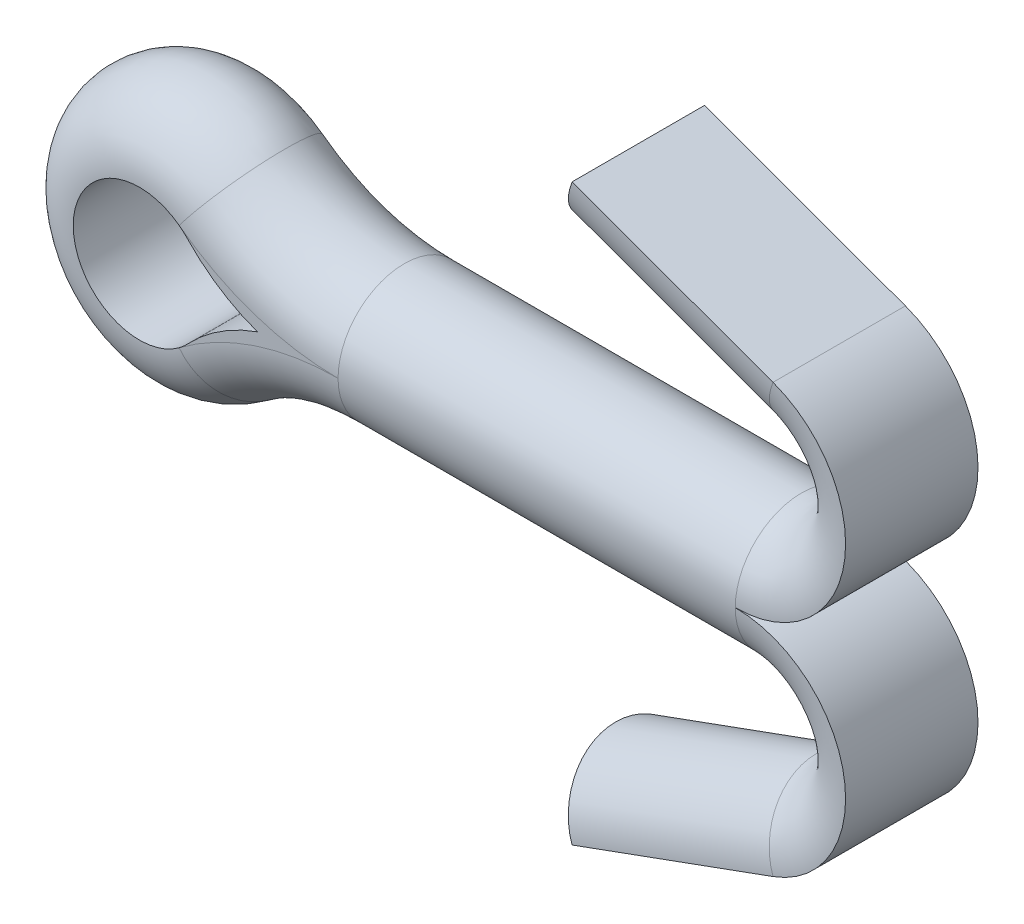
ISO-10303-21;
HEADER;
FILE_DESCRIPTION(('STEP AP214'),'2;1');
FILE_NAME('part.step','',(''),(''),'','','');
FILE_SCHEMA(('AUTOMOTIVE_DESIGN { 1 0 10303 214 1 1 1 1 }'));
ENDSEC;
DATA;
#1=APPLICATION_CONTEXT('core data for automotive mechanical design processes');
#2=APPLICATION_PROTOCOL_DEFINITION('international standard','automotive_design',2000,#1);
#3=PRODUCT_CONTEXT('',#1,'mechanical');
#4=PRODUCT('Part','Part','',(#3));
#5=PRODUCT_RELATED_PRODUCT_CATEGORY('part','',(#4));
#6=PRODUCT_DEFINITION_FORMATION('','',#4);
#7=PRODUCT_DEFINITION_CONTEXT('part definition',#1,'design');
#8=PRODUCT_DEFINITION('design','',#6,#7);
#9=PRODUCT_DEFINITION_SHAPE('','',#8);
#10=(LENGTH_UNIT() NAMED_UNIT(*) SI_UNIT(.MILLI.,.METRE.));
#11=(NAMED_UNIT(*) PLANE_ANGLE_UNIT() SI_UNIT($,.RADIAN.));
#12=(NAMED_UNIT(*) SI_UNIT($,.STERADIAN.) SOLID_ANGLE_UNIT());
#13=UNCERTAINTY_MEASURE_WITH_UNIT(LENGTH_MEASURE(1.E-05),#10,'distance_accuracy_value','');
#14=(GEOMETRIC_REPRESENTATION_CONTEXT(3) GLOBAL_UNCERTAINTY_ASSIGNED_CONTEXT((#13)) GLOBAL_UNIT_ASSIGNED_CONTEXT((#10,
#11,#12)) REPRESENTATION_CONTEXT('',''));
#15=CARTESIAN_POINT('',(0.,0.,0.));
#16=DIRECTION('',(0.,0.,1.));
#17=DIRECTION('',(1.,0.,0.));
#18=AXIS2_PLACEMENT_3D('',#15,#16,#17);
#19=CARTESIAN_POINT('',(0.,0.,1.5));
#20=DIRECTION('',(0.,0.,-1.));
#21=DIRECTION('',(-1.,0.,0.));
#22=AXIS2_PLACEMENT_3D('',#19,#20,#21);
#23=CYLINDRICAL_SURFACE('',#22,1.5);
#24=CARTESIAN_POINT('',(0.,0.,-1.5));
#25=DIRECTION('',(0.,0.,-1.));
#26=DIRECTION('',(1.,0.,0.));
#27=AXIS2_PLACEMENT_3D('',#24,#25,#26);
#28=CIRCLE('',#27,1.5);
#29=CARTESIAN_POINT('',(1.09090909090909,-1.02952287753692,-1.5));
#30=VERTEX_POINT('',#29);
#31=CARTESIAN_POINT('',(0.900000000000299,-1.19999999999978,-1.5));
#32=VERTEX_POINT('',#31);
#33=EDGE_CURVE('E161',#30,#32,#28,.T.);
#34=ORIENTED_EDGE('',*,*,#33,.T.);
#35=CARTESIAN_POINT('',(0.900000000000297,1.19999999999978,-1.5));
#36=VERTEX_POINT('',#35);
#37=EDGE_CURVE('E165',#32,#36,#28,.T.);
#38=ORIENTED_EDGE('',*,*,#37,.T.);
#39=CARTESIAN_POINT('',(1.09090909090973,1.02952287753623,-1.5));
#40=VERTEX_POINT('',#39);
#41=EDGE_CURVE('E160',#36,#40,#28,.T.);
#42=ORIENTED_EDGE('',*,*,#41,.T.);
#43=DIRECTION('',(0.,0.,-1.));
#44=VECTOR('',#43,1.);
#45=CARTESIAN_POINT('',(1.09090909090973,1.02952287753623,1.5));
#46=LINE('',#45,#44);
#47=CARTESIAN_POINT('',(1.09090909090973,1.02952287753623,1.5));
#48=VERTEX_POINT('',#47);
#49=EDGE_CURVE('E125',#48,#40,#46,.T.);
#50=ORIENTED_EDGE('',*,*,#49,.F.);
#51=CARTESIAN_POINT('',(0.,0.,1.5));
#52=DIRECTION('',(0.,0.,-1.));
#53=DIRECTION('',(1.,0.,0.));
#54=AXIS2_PLACEMENT_3D('',#51,#52,#53);
#55=CIRCLE('',#54,1.5);
#56=CARTESIAN_POINT('',(0.900000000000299,1.19999999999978,1.5));
#57=VERTEX_POINT('',#56);
#58=EDGE_CURVE('E182',#57,#48,#55,.T.);
#59=ORIENTED_EDGE('',*,*,#58,.F.);
#60=CARTESIAN_POINT('',(0.900000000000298,-1.19999999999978,1.5));
#61=VERTEX_POINT('',#60);
#62=EDGE_CURVE('E187',#61,#57,#55,.T.);
#63=ORIENTED_EDGE('',*,*,#62,.F.);
#64=CARTESIAN_POINT('',(1.09090909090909,-1.02952287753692,1.5));
#65=VERTEX_POINT('',#64);
#66=EDGE_CURVE('E183',#65,#61,#55,.T.);
#67=ORIENTED_EDGE('',*,*,#66,.F.);
#68=DIRECTION('',(0.,0.,-1.));
#69=VECTOR('',#68,1.);
#70=CARTESIAN_POINT('',(1.09090909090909,-1.02952287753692,1.5));
#71=LINE('',#70,#69);
#72=EDGE_CURVE('E191',#65,#30,#71,.T.);
#73=ORIENTED_EDGE('',*,*,#72,.T.);
#74=EDGE_LOOP('',(#34,#38,#42,#50,#59,#63,#67,#73));
#75=FACE_BOUND('',#74,.T.);
#76=ADVANCED_FACE('F17',(#75),#23,.F.);
#77=CARTESIAN_POINT('',(4.00000000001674,-3.77491721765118,1.5));
#78=DIRECTION('',(0.,0.,-1.));
#79=DIRECTION('',(-1.,0.,0.));
#80=AXIS2_PLACEMENT_3D('',#77,#78,#79);
#81=CYLINDRICAL_SURFACE('',#80,4.00000000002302);
#82=CARTESIAN_POINT('',(4.00000000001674,-3.77491721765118,-1.5));
#83=DIRECTION('',(0.,0.,1.));
#84=DIRECTION('',(1.,0.,0.));
#85=AXIS2_PLACEMENT_3D('',#82,#83,#84);
#86=CIRCLE('',#85,4.00000000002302);
#87=CARTESIAN_POINT('',(2.67712434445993,0.,-1.5));
#88=VERTEX_POINT('',#87);
#89=EDGE_CURVE('E152',#88,#30,#86,.T.);
#90=ORIENTED_EDGE('',*,*,#89,.T.);
#91=ORIENTED_EDGE('',*,*,#72,.F.);
#92=CARTESIAN_POINT('',(4.00000000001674,-3.77491721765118,1.5));
#93=DIRECTION('',(0.,0.,1.));
#94=DIRECTION('',(1.,0.,0.));
#95=AXIS2_PLACEMENT_3D('',#92,#93,#94);
#96=CIRCLE('',#95,4.00000000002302);
#97=CARTESIAN_POINT('',(2.67712434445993,0.,1.5));
#98=VERTEX_POINT('',#97);
#99=EDGE_CURVE('E176',#98,#65,#96,.T.);
#100=ORIENTED_EDGE('',*,*,#99,.F.);
#101=DIRECTION('',(0.,0.,-1.));
#102=VECTOR('',#101,1.);
#103=CARTESIAN_POINT('',(2.67712434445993,0.,1.5));
#104=LINE('',#103,#102);
#105=EDGE_CURVE('E190',#98,#88,#104,.T.);
#106=ORIENTED_EDGE('',*,*,#105,.T.);
#107=EDGE_LOOP('',(#90,#91,#100,#106));
#108=FACE_BOUND('',#107,.T.);
#109=ADVANCED_FACE('F235',(#108),#81,.T.);
#110=CARTESIAN_POINT('',(9.80238409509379,6.50626655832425,1.5));
#111=DIRECTION('',(-0.939692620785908,0.34202014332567,0.));
#112=DIRECTION('',(-0.34202014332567,-0.939692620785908,0.));
#113=AXIS2_PLACEMENT_3D('',#110,#111,#112);
#114=PLANE('',#113);
#115=DIRECTION('',(0.,0.,-1.));
#116=VECTOR('',#115,1.);
#117=CARTESIAN_POINT('',(9.80238409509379,6.50626655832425,1.5));
#118=LINE('',#117,#116);
#119=CARTESIAN_POINT('',(9.80238409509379,6.50626655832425,1.5));
#120=VERTEX_POINT('',#119);
#121=CARTESIAN_POINT('',(9.80238409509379,6.50626655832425,-1.5));
#122=VERTEX_POINT('',#121);
#123=EDGE_CURVE('E123',#120,#122,#118,.T.);
#124=ORIENTED_EDGE('',*,*,#123,.T.);
#125=CARTESIAN_POINT('',(9.80238409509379,6.50626655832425,0.));
#126=DIRECTION('',(-0.939692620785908,0.34202014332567,0.));
#127=DIRECTION('',(-0.34202014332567,-0.939692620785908,0.));
#128=AXIS2_PLACEMENT_3D('',#125,#126,#127);
#129=CIRCLE('',#128,1.5);
#130=EDGE_CURVE('E110',#122,#120,#129,.T.);
#131=ORIENTED_EDGE('',*,*,#130,.T.);
#132=EDGE_LOOP('',(#124,#131));
#133=FACE_BOUND('',#132,.T.);
#134=ADVANCED_FACE('F19',(#133),#114,.T.);
#135=CARTESIAN_POINT('',(9.80238409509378,6.50626655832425,1.5));
#136=DIRECTION('',(0.342020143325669,0.939692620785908,0.));
#137=DIRECTION('',(-0.939692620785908,0.342020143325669,0.));
#138=AXIS2_PLACEMENT_3D('',#135,#136,#137);
#139=PLANE('',#138);
#140=DIRECTION('',(0.939692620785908,-0.342020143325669,0.));
#141=VECTOR('',#140,1.);
#142=CARTESIAN_POINT('',(9.80238409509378,6.50626655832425,-1.5));
#143=LINE('',#142,#141);
#144=CARTESIAN_POINT('',(14.3550503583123,4.84923155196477,-1.5));
#145=VERTEX_POINT('',#144);
#146=EDGE_CURVE('E115',#122,#145,#143,.T.);
#147=ORIENTED_EDGE('',*,*,#146,.F.);
#148=ORIENTED_EDGE('',*,*,#123,.F.);
#149=DIRECTION('',(0.939692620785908,-0.342020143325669,0.));
#150=VECTOR('',#149,1.);
#151=CARTESIAN_POINT('',(9.80238409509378,6.50626655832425,1.5));
#152=LINE('',#151,#150);
#153=CARTESIAN_POINT('',(14.3550503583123,4.84923155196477,1.5));
#154=VERTEX_POINT('',#153);
#155=EDGE_CURVE('E117',#120,#154,#152,.T.);
#156=ORIENTED_EDGE('',*,*,#155,.T.);
#157=DIRECTION('',(0.,0.,-1.));
#158=VECTOR('',#157,1.);
#159=CARTESIAN_POINT('',(14.3550503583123,4.84923155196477,1.5));
#160=LINE('',#159,#158);
#161=EDGE_CURVE('E126',#154,#145,#160,.T.);
#162=ORIENTED_EDGE('',*,*,#161,.T.);
#163=EDGE_LOOP('',(#147,#148,#156,#162));
#164=FACE_BOUND('',#163,.T.);
#165=ADVANCED_FACE('F129',(#164),#139,.T.);
#166=CARTESIAN_POINT('',(13.4999999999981,2.49999999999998,1.5));
#167=DIRECTION('',(0.,0.,-1.));
#168=DIRECTION('',(-1.,0.,0.));
#169=AXIS2_PLACEMENT_3D('',#166,#167,#168);
#170=CYLINDRICAL_SURFACE('',#169,2.5);
#171=CARTESIAN_POINT('',(13.4999999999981,2.49999999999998,-1.5));
#172=DIRECTION('',(0.,0.,-1.));
#173=DIRECTION('',(-1.,0.,0.));
#174=AXIS2_PLACEMENT_3D('',#171,#172,#173);
#175=CIRCLE('',#174,2.5);
#176=CARTESIAN_POINT('',(13.4999999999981,0.,-1.5));
#177=VERTEX_POINT('',#176);
#178=EDGE_CURVE('E132',#145,#177,#175,.T.);
#179=ORIENTED_EDGE('',*,*,#178,.F.);
#180=ORIENTED_EDGE('',*,*,#161,.F.);
#181=CARTESIAN_POINT('',(13.4999999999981,2.49999999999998,1.5));
#182=DIRECTION('',(0.,0.,-1.));
#183=DIRECTION('',(-1.,0.,0.));
#184=AXIS2_PLACEMENT_3D('',#181,#182,#183);
#185=CIRCLE('',#184,2.5);
#186=CARTESIAN_POINT('',(13.4999999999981,0.,1.5));
#187=VERTEX_POINT('',#186);
#188=EDGE_CURVE('E167',#154,#187,#185,.T.);
#189=ORIENTED_EDGE('',*,*,#188,.T.);
#190=DIRECTION('',(0.,0.,-1.));
#191=VECTOR('',#190,1.);
#192=CARTESIAN_POINT('',(13.4999999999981,0.,1.5));
#193=LINE('',#192,#191);
#194=EDGE_CURVE('E200',#187,#177,#193,.T.);
#195=ORIENTED_EDGE('',*,*,#194,.T.);
#196=EDGE_LOOP('',(#179,#180,#189,#195));
#197=FACE_BOUND('',#196,.T.);
#198=ADVANCED_FACE('F257',(#197),#170,.T.);
#199=CARTESIAN_POINT('',(13.4999999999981,-2.49999999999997,1.5));
#200=DIRECTION('',(0.,0.,-1.));
#201=DIRECTION('',(-1.,0.,0.));
#202=AXIS2_PLACEMENT_3D('',#199,#200,#201);
#203=CYLINDRICAL_SURFACE('',#202,2.5);
#204=CARTESIAN_POINT('',(13.4999999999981,-2.49999999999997,-1.5));
#205=DIRECTION('',(0.,0.,-1.));
#206=DIRECTION('',(-1.,0.,0.));
#207=AXIS2_PLACEMENT_3D('',#204,#205,#206);
#208=CIRCLE('',#207,2.5);
#209=CARTESIAN_POINT('',(14.3550503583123,-4.84923155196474,-1.5));
#210=VERTEX_POINT('',#209);
#211=EDGE_CURVE('E139',#177,#210,#208,.T.);
#212=ORIENTED_EDGE('',*,*,#211,.F.);
#213=ORIENTED_EDGE('',*,*,#194,.F.);
#214=CARTESIAN_POINT('',(13.4999999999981,-2.49999999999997,1.5));
#215=DIRECTION('',(0.,0.,-1.));
#216=DIRECTION('',(-1.,0.,0.));
#217=AXIS2_PLACEMENT_3D('',#214,#215,#216);
#218=CIRCLE('',#217,2.5);
#219=CARTESIAN_POINT('',(14.3550503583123,-4.84923155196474,1.5));
#220=VERTEX_POINT('',#219);
#221=EDGE_CURVE('E170',#187,#220,#218,.T.);
#222=ORIENTED_EDGE('',*,*,#221,.T.);
#223=DIRECTION('',(0.,0.,-1.));
#224=VECTOR('',#223,1.);
#225=CARTESIAN_POINT('',(14.3550503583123,-4.84923155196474,1.5));
#226=LINE('',#225,#224);
#227=EDGE_CURVE('E197',#220,#210,#226,.T.);
#228=ORIENTED_EDGE('',*,*,#227,.T.);
#229=EDGE_LOOP('',(#212,#213,#222,#228));
#230=FACE_BOUND('',#229,.T.);
#231=ADVANCED_FACE('F261',(#230),#203,.T.);
#232=CARTESIAN_POINT('',(14.3550503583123,-4.84923155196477,1.5));
#233=DIRECTION('',(0.342020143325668,-0.939692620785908,0.));
#234=DIRECTION('',(0.939692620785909,0.342020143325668,0.));
#235=AXIS2_PLACEMENT_3D('',#232,#233,#234);
#236=PLANE('',#235);
#237=DIRECTION('',(-0.939692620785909,-0.342020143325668,0.));
#238=VECTOR('',#237,1.);
#239=CARTESIAN_POINT('',(14.3550503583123,-4.84923155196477,-1.5));
#240=LINE('',#239,#238);
#241=CARTESIAN_POINT('',(9.80238409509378,-6.50626655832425,-1.5));
#242=VERTEX_POINT('',#241);
#243=EDGE_CURVE('E148',#210,#242,#240,.T.);
#244=ORIENTED_EDGE('',*,*,#243,.F.);
#245=ORIENTED_EDGE('',*,*,#227,.F.);
#246=DIRECTION('',(-0.939692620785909,-0.342020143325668,0.));
#247=VECTOR('',#246,1.);
#248=CARTESIAN_POINT('',(14.3550503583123,-4.84923155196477,1.5));
#249=LINE('',#248,#247);
#250=CARTESIAN_POINT('',(9.80238409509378,-6.50626655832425,1.5));
#251=VERTEX_POINT('',#250);
#252=EDGE_CURVE('E173',#220,#251,#249,.T.);
#253=ORIENTED_EDGE('',*,*,#252,.T.);
#254=DIRECTION('',(0.,0.,-1.));
#255=VECTOR('',#254,1.);
#256=CARTESIAN_POINT('',(9.80238409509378,-6.50626655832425,1.5));
#257=LINE('',#256,#255);
#258=EDGE_CURVE('E186',#251,#242,#257,.T.);
#259=ORIENTED_EDGE('',*,*,#258,.T.);
#260=EDGE_LOOP('',(#244,#245,#253,#259));
#261=FACE_BOUND('',#260,.T.);
#262=ADVANCED_FACE('F280',(#261),#236,.T.);
#263=CARTESIAN_POINT('',(9.80238409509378,-6.50626655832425,1.5));
#264=DIRECTION('',(-0.939692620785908,-0.342020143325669,0.));
#265=DIRECTION('',(0.342020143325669,-0.939692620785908,0.));
#266=AXIS2_PLACEMENT_3D('',#263,#264,#265);
#267=PLANE('',#266);
#268=CARTESIAN_POINT('',(9.80238409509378,-6.50626655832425,0.));
#269=DIRECTION('',(-0.939692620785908,-0.342020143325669,0.));
#270=DIRECTION('',(0.342020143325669,-0.939692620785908,0.));
#271=AXIS2_PLACEMENT_3D('',#268,#269,#270);
#272=CIRCLE('',#271,1.5);
#273=EDGE_CURVE('E121',#251,#242,#272,.T.);
#274=ORIENTED_EDGE('',*,*,#273,.T.);
#275=ORIENTED_EDGE('',*,*,#258,.F.);
#276=EDGE_LOOP('',(#274,#275));
#277=FACE_BOUND('',#276,.T.);
#278=ADVANCED_FACE('F282',(#277),#267,.T.);
#279=CARTESIAN_POINT('',(4.00000000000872,3.77491721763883,1.5));
#280=DIRECTION('',(0.,0.,-1.));
#281=DIRECTION('',(-1.,0.,0.));
#282=AXIS2_PLACEMENT_3D('',#279,#280,#281);
#283=CYLINDRICAL_SURFACE('',#282,4.00000000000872);
#284=CARTESIAN_POINT('',(4.00000000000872,3.77491721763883,-1.5));
#285=DIRECTION('',(0.,0.,1.));
#286=DIRECTION('',(1.,0.,0.));
#287=AXIS2_PLACEMENT_3D('',#284,#285,#286);
#288=CIRCLE('',#287,4.00000000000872);
#289=EDGE_CURVE('E156',#40,#88,#288,.T.);
#290=ORIENTED_EDGE('',*,*,#289,.T.);
#291=ORIENTED_EDGE('',*,*,#105,.F.);
#292=CARTESIAN_POINT('',(4.00000000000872,3.77491721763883,1.5));
#293=DIRECTION('',(0.,0.,1.));
#294=DIRECTION('',(1.,0.,0.));
#295=AXIS2_PLACEMENT_3D('',#292,#293,#294);
#296=CIRCLE('',#295,4.00000000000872);
#297=EDGE_CURVE('E179',#48,#98,#296,.T.);
#298=ORIENTED_EDGE('',*,*,#297,.F.);
#299=ORIENTED_EDGE('',*,*,#49,.T.);
#300=EDGE_LOOP('',(#290,#291,#298,#299));
#301=FACE_BOUND('',#300,.T.);
#302=ADVANCED_FACE('F233',(#301),#283,.T.);
#303=CARTESIAN_POINT('',(4.49999999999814,5.99999999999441,1.5));
#304=DIRECTION('',(0.,0.,1.));
#305=DIRECTION('',(1.,0.,0.));
#306=AXIS2_PLACEMENT_3D('',#303,#304,#305);
#307=PLANE('',#306);
#308=ORIENTED_EDGE('',*,*,#66,.T.);
#309=CARTESIAN_POINT('',(4.49999999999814,-5.99999999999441,1.5));
#310=DIRECTION('',(0.,0.,1.));
#311=DIRECTION('',(1.,0.,0.));
#312=AXIS2_PLACEMENT_3D('',#309,#310,#311);
#313=CIRCLE('',#312,5.99999999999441);
#314=CARTESIAN_POINT('',(4.49999999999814,0.,1.5));
#315=VERTEX_POINT('',#314);
#316=EDGE_CURVE('E205',#61,#315,#313,.F.);
#317=ORIENTED_EDGE('',*,*,#316,.T.);
#318=CARTESIAN_POINT('',(4.49999999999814,5.99999999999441,1.5));
#319=DIRECTION('',(0.,0.,1.));
#320=DIRECTION('',(1.,0.,0.));
#321=AXIS2_PLACEMENT_3D('',#318,#319,#320);
#322=CIRCLE('',#321,5.99999999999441);
#323=EDGE_CURVE('E193',#315,#57,#322,.F.);
#324=ORIENTED_EDGE('',*,*,#323,.T.);
#325=ORIENTED_EDGE('',*,*,#58,.T.);
#326=ORIENTED_EDGE('',*,*,#297,.T.);
#327=ORIENTED_EDGE('',*,*,#99,.T.);
#328=EDGE_LOOP('',(#308,#317,#324,#325,#326,#327));
#329=FACE_BOUND('',#328,.T.);
#330=ADVANCED_FACE('F238',(#329),#307,.T.);
#331=CARTESIAN_POINT('',(4.49999999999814,5.99999999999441,-1.5));
#332=DIRECTION('',(0.,0.,1.));
#333=DIRECTION('',(1.,0.,0.));
#334=AXIS2_PLACEMENT_3D('',#331,#332,#333);
#335=PLANE('',#334);
#336=ORIENTED_EDGE('',*,*,#41,.F.);
#337=CARTESIAN_POINT('',(4.49999999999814,5.99999999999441,-1.5));
#338=DIRECTION('',(0.,0.,1.));
#339=DIRECTION('',(1.,0.,0.));
#340=AXIS2_PLACEMENT_3D('',#337,#338,#339);
#341=CIRCLE('',#340,5.99999999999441);
#342=CARTESIAN_POINT('',(4.49999999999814,0.,-1.5));
#343=VERTEX_POINT('',#342);
#344=EDGE_CURVE('E11',#36,#343,#341,.T.);
#345=ORIENTED_EDGE('',*,*,#344,.T.);
#346=CARTESIAN_POINT('',(4.49999999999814,-5.99999999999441,-1.5));
#347=DIRECTION('',(0.,0.,1.));
#348=DIRECTION('',(1.,0.,0.));
#349=AXIS2_PLACEMENT_3D('',#346,#347,#348);
#350=CIRCLE('',#349,5.99999999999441);
#351=EDGE_CURVE('E25',#343,#32,#350,.T.);
#352=ORIENTED_EDGE('',*,*,#351,.T.);
#353=ORIENTED_EDGE('',*,*,#33,.F.);
#354=ORIENTED_EDGE('',*,*,#89,.F.);
#355=ORIENTED_EDGE('',*,*,#289,.F.);
#356=EDGE_LOOP('',(#336,#345,#352,#353,#354,#355));
#357=FACE_BOUND('',#356,.T.);
#358=ADVANCED_FACE('F214',(#357),#335,.F.);
#359=CARTESIAN_POINT('',(14.3550503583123,4.84923155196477,0.));
#360=DIRECTION('',(-0.939692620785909,0.342020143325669,0.));
#361=DIRECTION('',(-0.342020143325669,-0.939692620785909,0.));
#362=AXIS2_PLACEMENT_3D('',#359,#360,#361);
#363=CYLINDRICAL_SURFACE('',#362,1.5);
#364=ORIENTED_EDGE('',*,*,#130,.F.);
#365=ORIENTED_EDGE('',*,*,#146,.T.);
#366=CARTESIAN_POINT('',(14.3550503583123,4.84923155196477,0.));
#367=DIRECTION('',(0.939692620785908,-0.342020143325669,0.));
#368=DIRECTION('',(0.342020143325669,0.939692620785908,0.));
#369=AXIS2_PLACEMENT_3D('',#366,#367,#368);
#370=CIRCLE('',#369,1.5);
#371=EDGE_CURVE('E141',#154,#145,#370,.T.);
#372=ORIENTED_EDGE('',*,*,#371,.F.);
#373=ORIENTED_EDGE('',*,*,#155,.F.);
#374=EDGE_LOOP('',(#364,#365,#372,#373));
#375=FACE_BOUND('',#374,.T.);
#376=ADVANCED_FACE('F112',(#375),#363,.T.);
#377=CARTESIAN_POINT('',(0.,0.,0.));
#378=DIRECTION('',(0.,0.,1.));
#379=DIRECTION('',(1.,0.,0.));
#380=AXIS2_PLACEMENT_3D('',#377,#378,#379);
#381=DEGENERATE_TOROIDAL_SURFACE('',#380,1.5,1.5,.T.);
#382=CARTESIAN_POINT('',(0.900000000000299,-1.19999999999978,0.));
#383=DIRECTION('',(0.799999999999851,0.600000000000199,0.));
#384=DIRECTION('',(-0.600000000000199,0.799999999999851,0.));
#385=AXIS2_PLACEMENT_3D('',#382,#383,#384);
#386=CIRCLE('',#385,1.5);
#387=EDGE_CURVE('E223',#61,#32,#386,.T.);
#388=ORIENTED_EDGE('',*,*,#387,.F.);
#389=ORIENTED_EDGE('',*,*,#62,.T.);
#390=CARTESIAN_POINT('',(0.900000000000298,1.19999999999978,0.));
#391=DIRECTION('',(0.799999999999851,-0.600000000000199,0.));
#392=DIRECTION('',(0.600000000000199,0.799999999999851,0.));
#393=AXIS2_PLACEMENT_3D('',#390,#391,#392);
#394=CIRCLE('',#393,1.5);
#395=EDGE_CURVE('E40',#36,#57,#394,.T.);
#396=ORIENTED_EDGE('',*,*,#395,.F.);
#397=ORIENTED_EDGE('',*,*,#37,.F.);
#398=EDGE_LOOP('',(#388,#389,#396,#397));
#399=FACE_BOUND('',#398,.T.);
#400=ADVANCED_FACE('F222',(#399),#381,.T.);
#401=CARTESIAN_POINT('',(4.49999999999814,5.99999999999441,0.));
#402=DIRECTION('',(0.,0.,1.));
#403=DIRECTION('',(1.,0.,0.));
#404=AXIS2_PLACEMENT_3D('',#401,#402,#403);
#405=TOROIDAL_SURFACE('',#404,5.99999999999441,1.5);
#406=ORIENTED_EDGE('',*,*,#395,.T.);
#407=ORIENTED_EDGE('',*,*,#323,.F.);
#408=CARTESIAN_POINT('',(4.49999999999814,0.,0.));
#409=DIRECTION('',(1.,0.,0.));
#410=DIRECTION('',(0.,0.,-1.));
#411=AXIS2_PLACEMENT_3D('',#408,#409,#410);
#412=CIRCLE('',#411,1.5);
#413=EDGE_CURVE('E32',#343,#315,#412,.T.);
#414=ORIENTED_EDGE('',*,*,#413,.F.);
#415=ORIENTED_EDGE('',*,*,#344,.F.);
#416=EDGE_LOOP('',(#406,#407,#414,#415));
#417=FACE_BOUND('',#416,.T.);
#418=ADVANCED_FACE('F239',(#417),#405,.T.);
#419=CARTESIAN_POINT('',(13.4999999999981,2.49999999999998,0.));
#420=DIRECTION('',(0.,0.,1.));
#421=DIRECTION('',(1.,0.,0.));
#422=AXIS2_PLACEMENT_3D('',#419,#420,#421);
#423=TOROIDAL_SURFACE('',#422,2.5,1.5);
#424=ORIENTED_EDGE('',*,*,#371,.T.);
#425=ORIENTED_EDGE('',*,*,#178,.T.);
#426=CARTESIAN_POINT('',(13.4999999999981,0.,0.));
#427=DIRECTION('',(-1.,0.,0.));
#428=DIRECTION('',(0.,-1.,0.));
#429=AXIS2_PLACEMENT_3D('',#426,#427,#428);
#430=CIRCLE('',#429,1.5);
#431=EDGE_CURVE('E244',#187,#177,#430,.T.);
#432=ORIENTED_EDGE('',*,*,#431,.F.);
#433=ORIENTED_EDGE('',*,*,#188,.F.);
#434=EDGE_LOOP('',(#424,#425,#432,#433));
#435=FACE_BOUND('',#434,.T.);
#436=ADVANCED_FACE('F253',(#435),#423,.T.);
#437=CARTESIAN_POINT('',(4.49999999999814,-5.99999999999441,0.));
#438=DIRECTION('',(0.,0.,1.));
#439=DIRECTION('',(1.,0.,0.));
#440=AXIS2_PLACEMENT_3D('',#437,#438,#439);
#441=TOROIDAL_SURFACE('',#440,5.99999999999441,1.5);
#442=ORIENTED_EDGE('',*,*,#387,.T.);
#443=ORIENTED_EDGE('',*,*,#351,.F.);
#444=CARTESIAN_POINT('',(4.49999999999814,0.,0.));
#445=DIRECTION('',(1.,0.,0.));
#446=DIRECTION('',(0.,0.,-1.));
#447=AXIS2_PLACEMENT_3D('',#444,#445,#446);
#448=CIRCLE('',#447,1.5);
#449=CARTESIAN_POINT('',(4.49999999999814,-1.5,0.));
#450=VERTEX_POINT('',#449);
#451=EDGE_CURVE('E242',#450,#343,#448,.T.);
#452=ORIENTED_EDGE('',*,*,#451,.F.);
#453=CARTESIAN_POINT('',(4.49999999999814,0.,0.));
#454=DIRECTION('',(1.,0.,0.));
#455=DIRECTION('',(0.,0.,-1.));
#456=AXIS2_PLACEMENT_3D('',#453,#454,#455);
#457=CIRCLE('',#456,1.5);
#458=EDGE_CURVE('E241',#315,#450,#457,.T.);
#459=ORIENTED_EDGE('',*,*,#458,.F.);
#460=ORIENTED_EDGE('',*,*,#316,.F.);
#461=EDGE_LOOP('',(#442,#443,#452,#459,#460));
#462=FACE_BOUND('',#461,.T.);
#463=ADVANCED_FACE('F240',(#462),#441,.T.);
#464=CARTESIAN_POINT('',(4.49999999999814,0.,0.));
#465=DIRECTION('',(1.,0.,0.));
#466=DIRECTION('',(0.,0.,-1.));
#467=AXIS2_PLACEMENT_3D('',#464,#465,#466);
#468=CYLINDRICAL_SURFACE('',#467,1.5);
#469=ORIENTED_EDGE('',*,*,#431,.T.);
#470=CARTESIAN_POINT('',(13.4999999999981,0.,0.));
#471=DIRECTION('',(-1.,0.,0.));
#472=DIRECTION('',(0.,0.,1.));
#473=AXIS2_PLACEMENT_3D('',#470,#471,#472);
#474=CIRCLE('',#473,1.5);
#475=CARTESIAN_POINT('',(13.4999999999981,-1.49999999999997,0.));
#476=VERTEX_POINT('',#475);
#477=EDGE_CURVE('E267',#177,#476,#474,.T.);
#478=ORIENTED_EDGE('',*,*,#477,.T.);
#479=DIRECTION('',(-1.,0.,0.));
#480=VECTOR('',#479,1.);
#481=CARTESIAN_POINT('',(4.49999999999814,-1.5,0.));
#482=LINE('',#481,#480);
#483=EDGE_CURVE('E120',#476,#450,#482,.T.);
#484=ORIENTED_EDGE('',*,*,#483,.T.);
#485=ORIENTED_EDGE('',*,*,#451,.T.);
#486=ORIENTED_EDGE('',*,*,#413,.T.);
#487=ORIENTED_EDGE('',*,*,#458,.T.);
#488=ORIENTED_EDGE('',*,*,#483,.F.);
#489=CARTESIAN_POINT('',(13.4999999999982,0.,0.));
#490=DIRECTION('',(1.,0.,0.));
#491=DIRECTION('',(0.,1.,0.));
#492=AXIS2_PLACEMENT_3D('',#489,#490,#491);
#493=CIRCLE('',#492,1.5);
#494=EDGE_CURVE('E245',#187,#476,#493,.T.);
#495=ORIENTED_EDGE('',*,*,#494,.F.);
#496=EDGE_LOOP('',(#469,#478,#484,#485,#486,#487,#488,#495));
#497=FACE_BOUND('',#496,.T.);
#498=ADVANCED_FACE('F247',(#497),#468,.T.);
#499=CARTESIAN_POINT('',(13.4999999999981,-2.49999999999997,0.));
#500=DIRECTION('',(0.,0.,1.));
#501=DIRECTION('',(1.,0.,0.));
#502=AXIS2_PLACEMENT_3D('',#499,#500,#501);
#503=TOROIDAL_SURFACE('',#502,2.5,1.5);
#504=ORIENTED_EDGE('',*,*,#494,.T.);
#505=ORIENTED_EDGE('',*,*,#477,.F.);
#506=ORIENTED_EDGE('',*,*,#211,.T.);
#507=CARTESIAN_POINT('',(14.3550503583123,-4.84923155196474,0.));
#508=DIRECTION('',(-0.939692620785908,-0.342020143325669,0.));
#509=DIRECTION('',(0.342020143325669,-0.939692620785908,0.));
#510=AXIS2_PLACEMENT_3D('',#507,#508,#509);
#511=CIRCLE('',#510,1.5);
#512=EDGE_CURVE('E271',#220,#210,#511,.T.);
#513=ORIENTED_EDGE('',*,*,#512,.F.);
#514=ORIENTED_EDGE('',*,*,#221,.F.);
#515=EDGE_LOOP('',(#504,#505,#506,#513,#514));
#516=FACE_BOUND('',#515,.T.);
#517=ADVANCED_FACE('F268',(#516),#503,.T.);
#518=CARTESIAN_POINT('',(14.3550503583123,-4.84923155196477,0.));
#519=DIRECTION('',(0.939692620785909,0.342020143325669,0.));
#520=DIRECTION('',(-0.342020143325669,0.939692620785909,0.));
#521=AXIS2_PLACEMENT_3D('',#518,#519,#520);
#522=CYLINDRICAL_SURFACE('',#521,1.5);
#523=ORIENTED_EDGE('',*,*,#273,.F.);
#524=ORIENTED_EDGE('',*,*,#252,.F.);
#525=ORIENTED_EDGE('',*,*,#512,.T.);
#526=ORIENTED_EDGE('',*,*,#243,.T.);
#527=EDGE_LOOP('',(#523,#524,#525,#526));
#528=FACE_BOUND('',#527,.T.);
#529=ADVANCED_FACE('F278',(#528),#522,.T.);
#530=CLOSED_SHELL('',(#76,#109,#134,#165,#198,#231,#262,#278,#302,#330,#358,#376,#400,#418,#436,
#463,#498,#517,#529));
#531=MANIFOLD_SOLID_BREP('B1',#530);
#532=ADVANCED_BREP_SHAPE_REPRESENTATION('',(#18,#531),#14);
#533=SHAPE_DEFINITION_REPRESENTATION(#9,#532);
ENDSEC;
END-ISO-10303-21;
